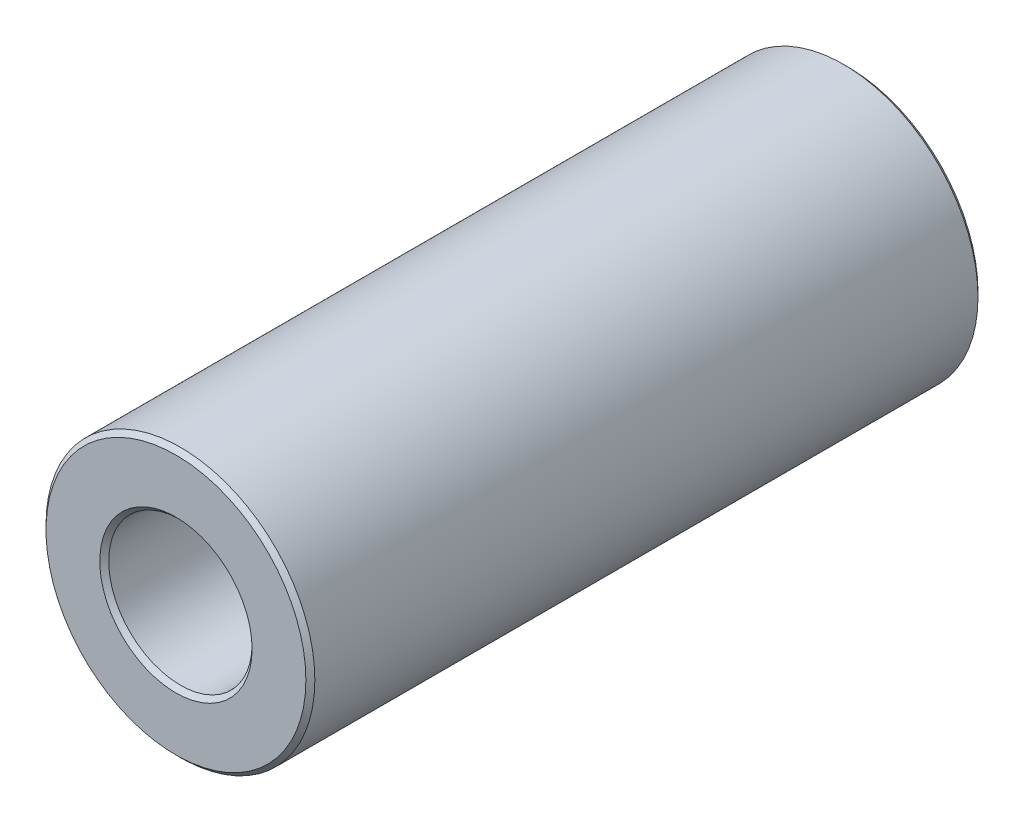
ISO-10303-21;
HEADER;
FILE_DESCRIPTION(('STEP AP214'),'2;1');
FILE_NAME('part.step','',(''),(''),'','','');
FILE_SCHEMA(('AUTOMOTIVE_DESIGN { 1 0 10303 214 1 1 1 1 }'));
ENDSEC;
DATA;
#1=APPLICATION_CONTEXT('core data for automotive mechanical design processes');
#2=APPLICATION_PROTOCOL_DEFINITION('international standard','automotive_design',2000,#1);
#3=PRODUCT_CONTEXT('',#1,'mechanical');
#4=PRODUCT('Part','Part','',(#3));
#5=PRODUCT_RELATED_PRODUCT_CATEGORY('part','',(#4));
#6=PRODUCT_DEFINITION_FORMATION('','',#4);
#7=PRODUCT_DEFINITION_CONTEXT('part definition',#1,'design');
#8=PRODUCT_DEFINITION('design','',#6,#7);
#9=PRODUCT_DEFINITION_SHAPE('','',#8);
#10=(LENGTH_UNIT() NAMED_UNIT(*) SI_UNIT(.MILLI.,.METRE.));
#11=(NAMED_UNIT(*) PLANE_ANGLE_UNIT() SI_UNIT($,.RADIAN.));
#12=(NAMED_UNIT(*) SI_UNIT($,.STERADIAN.) SOLID_ANGLE_UNIT());
#13=UNCERTAINTY_MEASURE_WITH_UNIT(LENGTH_MEASURE(1.E-05),#10,'distance_accuracy_value','');
#14=(GEOMETRIC_REPRESENTATION_CONTEXT(3) GLOBAL_UNCERTAINTY_ASSIGNED_CONTEXT((#13)) GLOBAL_UNIT_ASSIGNED_CONTEXT((#10,
#11,#12)) REPRESENTATION_CONTEXT('',''));
#15=CARTESIAN_POINT('',(0.,0.,0.));
#16=DIRECTION('',(0.,0.,1.));
#17=DIRECTION('',(1.,0.,0.));
#18=AXIS2_PLACEMENT_3D('',#15,#16,#17);
#19=CARTESIAN_POINT('',(0.,0.,7.5));
#20=DIRECTION('',(0.,0.,1.));
#21=DIRECTION('',(1.,0.,0.));
#22=AXIS2_PLACEMENT_3D('',#19,#20,#21);
#23=PLANE('',#22);
#24=CARTESIAN_POINT('',(0.,0.,7.5));
#25=DIRECTION('',(0.,0.,1.));
#26=DIRECTION('',(1.,0.,0.));
#27=AXIS2_PLACEMENT_3D('',#24,#25,#26);
#28=CIRCLE('',#27,1.7);
#29=CARTESIAN_POINT('',(1.7,0.,7.5));
#30=VERTEX_POINT('',#29);
#31=EDGE_CURVE('E10',#30,#30,#28,.F.);
#32=ORIENTED_EDGE('',*,*,#31,.T.);
#33=EDGE_LOOP('',(#32));
#34=FACE_BOUND('',#33,.T.);
#35=CARTESIAN_POINT('',(0.,0.,7.5));
#36=DIRECTION('',(0.,0.,1.));
#37=DIRECTION('',(1.,0.,0.));
#38=AXIS2_PLACEMENT_3D('',#35,#36,#37);
#39=CIRCLE('',#38,2.9);
#40=CARTESIAN_POINT('',(2.9,0.,7.5));
#41=VERTEX_POINT('',#40);
#42=EDGE_CURVE('E45',#41,#41,#39,.T.);
#43=ORIENTED_EDGE('',*,*,#42,.T.);
#44=EDGE_LOOP('',(#43));
#45=FACE_BOUND('',#44,.T.);
#46=ADVANCED_FACE('F37',(#34,#45),#23,.T.);
#47=CARTESIAN_POINT('',(0.,0.,-7.5));
#48=DIRECTION('',(0.,0.,1.));
#49=DIRECTION('',(1.,0.,0.));
#50=AXIS2_PLACEMENT_3D('',#47,#48,#49);
#51=PLANE('',#50);
#52=CARTESIAN_POINT('',(0.,0.,-7.5));
#53=DIRECTION('',(0.,0.,1.));
#54=DIRECTION('',(1.,0.,0.));
#55=AXIS2_PLACEMENT_3D('',#52,#53,#54);
#56=CIRCLE('',#55,2.9);
#57=CARTESIAN_POINT('',(2.9,0.,-7.5));
#58=VERTEX_POINT('',#57);
#59=EDGE_CURVE('E62',#58,#58,#56,.F.);
#60=ORIENTED_EDGE('',*,*,#59,.T.);
#61=EDGE_LOOP('',(#60));
#62=FACE_BOUND('',#61,.T.);
#63=CARTESIAN_POINT('',(0.,0.,-7.5));
#64=DIRECTION('',(0.,0.,1.));
#65=DIRECTION('',(1.,0.,0.));
#66=AXIS2_PLACEMENT_3D('',#63,#64,#65);
#67=CIRCLE('',#66,1.7);
#68=CARTESIAN_POINT('',(1.7,0.,-7.5));
#69=VERTEX_POINT('',#68);
#70=EDGE_CURVE('E66',#69,#69,#67,.T.);
#71=ORIENTED_EDGE('',*,*,#70,.T.);
#72=EDGE_LOOP('',(#71));
#73=FACE_BOUND('',#72,.T.);
#74=ADVANCED_FACE('F89',(#62,#73),#51,.F.);
#75=CARTESIAN_POINT('',(0.,0.,7.5));
#76=DIRECTION('',(0.,0.,-1.));
#77=DIRECTION('',(-1.,0.,0.));
#78=AXIS2_PLACEMENT_3D('',#75,#76,#77);
#79=CYLINDRICAL_SURFACE('',#78,3.);
#80=CARTESIAN_POINT('',(0.,0.,-7.4));
#81=DIRECTION('',(0.,0.,1.));
#82=DIRECTION('',(1.,0.,0.));
#83=AXIS2_PLACEMENT_3D('',#80,#81,#82);
#84=CIRCLE('',#83,3.);
#85=CARTESIAN_POINT('',(3.,0.,-7.4));
#86=VERTEX_POINT('',#85);
#87=EDGE_CURVE('E69',#86,#86,#84,.T.);
#88=ORIENTED_EDGE('',*,*,#87,.T.);
#89=EDGE_LOOP('',(#88));
#90=FACE_BOUND('',#89,.T.);
#91=CARTESIAN_POINT('',(0.,0.,7.4));
#92=DIRECTION('',(0.,0.,1.));
#93=DIRECTION('',(1.,0.,0.));
#94=AXIS2_PLACEMENT_3D('',#91,#92,#93);
#95=CIRCLE('',#94,3.);
#96=CARTESIAN_POINT('',(3.,0.,7.4));
#97=VERTEX_POINT('',#96);
#98=EDGE_CURVE('E73',#97,#97,#95,.F.);
#99=ORIENTED_EDGE('',*,*,#98,.T.);
#100=EDGE_LOOP('',(#99));
#101=FACE_BOUND('',#100,.T.);
#102=ADVANCED_FACE('F78',(#90,#101),#79,.T.);
#103=CARTESIAN_POINT('',(0.,0.,7.5));
#104=DIRECTION('',(0.,0.,-1.));
#105=DIRECTION('',(-1.,0.,0.));
#106=AXIS2_PLACEMENT_3D('',#103,#104,#105);
#107=CYLINDRICAL_SURFACE('',#106,1.6);
#108=CARTESIAN_POINT('',(0.,0.,-7.4));
#109=DIRECTION('',(0.,0.,1.));
#110=DIRECTION('',(1.,0.,0.));
#111=AXIS2_PLACEMENT_3D('',#108,#109,#110);
#112=CIRCLE('',#111,1.6);
#113=CARTESIAN_POINT('',(1.6,0.,-7.4));
#114=VERTEX_POINT('',#113);
#115=EDGE_CURVE('E51',#114,#114,#112,.F.);
#116=ORIENTED_EDGE('',*,*,#115,.T.);
#117=EDGE_LOOP('',(#116));
#118=FACE_BOUND('',#117,.T.);
#119=CARTESIAN_POINT('',(0.,0.,7.4));
#120=DIRECTION('',(0.,0.,1.));
#121=DIRECTION('',(1.,0.,0.));
#122=AXIS2_PLACEMENT_3D('',#119,#120,#121);
#123=CIRCLE('',#122,1.6);
#124=CARTESIAN_POINT('',(1.6,0.,7.4));
#125=VERTEX_POINT('',#124);
#126=EDGE_CURVE('E57',#125,#125,#123,.T.);
#127=ORIENTED_EDGE('',*,*,#126,.T.);
#128=EDGE_LOOP('',(#127));
#129=FACE_BOUND('',#128,.T.);
#130=ADVANCED_FACE('F97',(#118,#129),#107,.F.);
#131=CARTESIAN_POINT('',(0.,0.,-7.4));
#132=DIRECTION('',(0.,0.,1.));
#133=DIRECTION('',(1.,0.,0.));
#134=AXIS2_PLACEMENT_3D('',#131,#132,#133);
#135=CONICAL_SURFACE('',#134,3.,0.785398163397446);
#136=ORIENTED_EDGE('',*,*,#59,.F.);
#137=EDGE_LOOP('',(#136));
#138=FACE_BOUND('',#137,.T.);
#139=ORIENTED_EDGE('',*,*,#87,.F.);
#140=EDGE_LOOP('',(#139));
#141=FACE_BOUND('',#140,.T.);
#142=ADVANCED_FACE('F102',(#138,#141),#135,.T.);
#143=CARTESIAN_POINT('',(0.,0.,-7.5));
#144=DIRECTION('',(0.,0.,-1.));
#145=DIRECTION('',(-1.,0.,0.));
#146=AXIS2_PLACEMENT_3D('',#143,#144,#145);
#147=CONICAL_SURFACE('',#146,1.7,0.785398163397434);
#148=ORIENTED_EDGE('',*,*,#115,.F.);
#149=EDGE_LOOP('',(#148));
#150=FACE_BOUND('',#149,.T.);
#151=ORIENTED_EDGE('',*,*,#70,.F.);
#152=EDGE_LOOP('',(#151));
#153=FACE_BOUND('',#152,.T.);
#154=ADVANCED_FACE('F86',(#150,#153),#147,.F.);
#155=CARTESIAN_POINT('',(0.,0.,7.4));
#156=DIRECTION('',(0.,0.,1.));
#157=DIRECTION('',(1.,0.,0.));
#158=AXIS2_PLACEMENT_3D('',#155,#156,#157);
#159=CONICAL_SURFACE('',#158,1.6,0.785398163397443);
#160=ORIENTED_EDGE('',*,*,#31,.F.);
#161=EDGE_LOOP('',(#160));
#162=FACE_BOUND('',#161,.T.);
#163=ORIENTED_EDGE('',*,*,#126,.F.);
#164=EDGE_LOOP('',(#163));
#165=FACE_BOUND('',#164,.T.);
#166=ADVANCED_FACE('F82',(#162,#165),#159,.F.);
#167=CARTESIAN_POINT('',(0.,0.,7.5));
#168=DIRECTION('',(0.,0.,-1.));
#169=DIRECTION('',(-1.,0.,0.));
#170=AXIS2_PLACEMENT_3D('',#167,#168,#169);
#171=CONICAL_SURFACE('',#170,2.9,0.785398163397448);
#172=ORIENTED_EDGE('',*,*,#98,.F.);
#173=EDGE_LOOP('',(#172));
#174=FACE_BOUND('',#173,.T.);
#175=ORIENTED_EDGE('',*,*,#42,.F.);
#176=EDGE_LOOP('',(#175));
#177=FACE_BOUND('',#176,.T.);
#178=ADVANCED_FACE('F39',(#174,#177),#171,.T.);
#179=CLOSED_SHELL('',(#46,#74,#102,#130,#142,#154,#166,#178));
#180=MANIFOLD_SOLID_BREP('B2',#179);
#181=ADVANCED_BREP_SHAPE_REPRESENTATION('',(#18,#180),#14);
#182=SHAPE_DEFINITION_REPRESENTATION(#9,#181);
ENDSEC;
END-ISO-10303-21;
